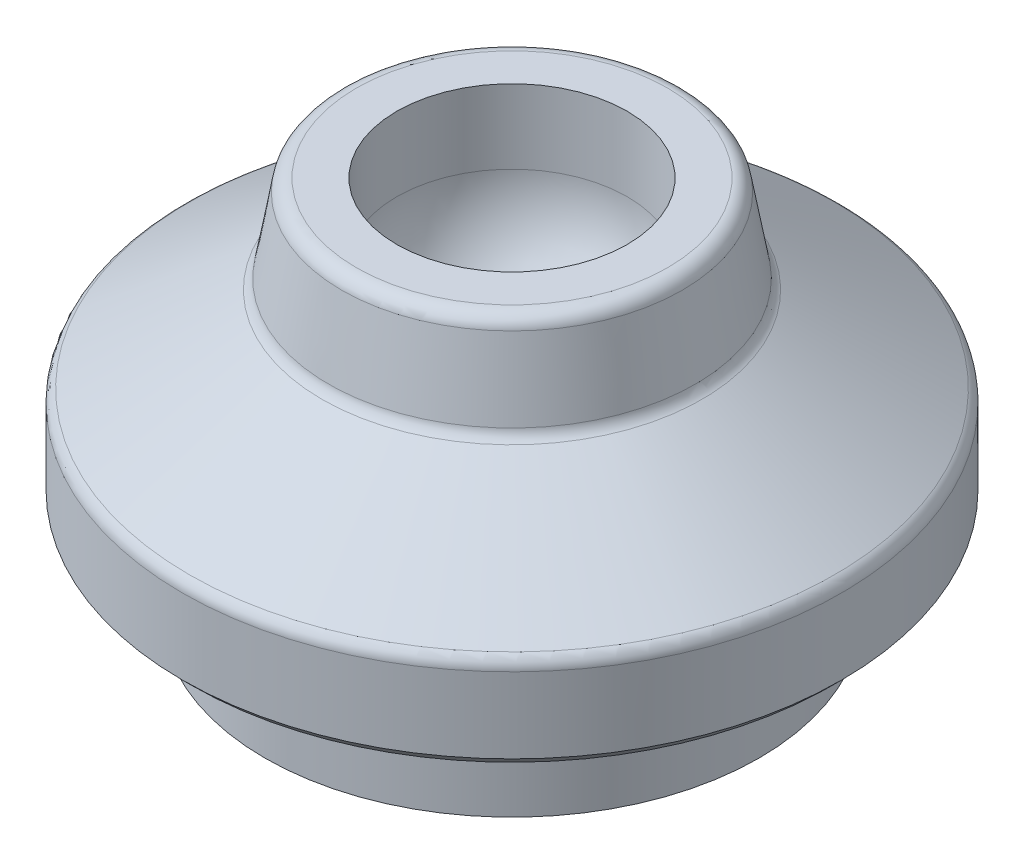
ISO-10303-21;
HEADER;
FILE_DESCRIPTION(('STEP AP214'),'2;1');
FILE_NAME('part.step','',(''),(''),'','','');
FILE_SCHEMA(('AUTOMOTIVE_DESIGN { 1 0 10303 214 1 1 1 1 }'));
ENDSEC;
DATA;
#1=APPLICATION_CONTEXT('core data for automotive mechanical design processes');
#2=APPLICATION_PROTOCOL_DEFINITION('international standard','automotive_design',2000,#1);
#3=PRODUCT_CONTEXT('',#1,'mechanical');
#4=PRODUCT('Part','Part','',(#3));
#5=PRODUCT_RELATED_PRODUCT_CATEGORY('part','',(#4));
#6=PRODUCT_DEFINITION_FORMATION('','',#4);
#7=PRODUCT_DEFINITION_CONTEXT('part definition',#1,'design');
#8=PRODUCT_DEFINITION('design','',#6,#7);
#9=PRODUCT_DEFINITION_SHAPE('','',#8);
#10=(LENGTH_UNIT() NAMED_UNIT(*) SI_UNIT(.MILLI.,.METRE.));
#11=(NAMED_UNIT(*) PLANE_ANGLE_UNIT() SI_UNIT($,.RADIAN.));
#12=(NAMED_UNIT(*) SI_UNIT($,.STERADIAN.) SOLID_ANGLE_UNIT());
#13=UNCERTAINTY_MEASURE_WITH_UNIT(LENGTH_MEASURE(1.E-05),#10,'distance_accuracy_value','');
#14=(GEOMETRIC_REPRESENTATION_CONTEXT(3) GLOBAL_UNCERTAINTY_ASSIGNED_CONTEXT((#13)) GLOBAL_UNIT_ASSIGNED_CONTEXT((#10,
#11,#12)) REPRESENTATION_CONTEXT('',''));
#15=CARTESIAN_POINT('',(0.,0.,0.));
#16=DIRECTION('',(0.,0.,1.));
#17=DIRECTION('',(1.,0.,0.));
#18=AXIS2_PLACEMENT_3D('',#15,#16,#17);
#19=CARTESIAN_POINT('',(6.51901066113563,17.,0.));
#20=DIRECTION('',(0.,-1.,0.));
#21=DIRECTION('',(0.,0.,-1.));
#22=AXIS2_PLACEMENT_3D('',#19,#20,#21);
#23=PLANE('',#22);
#24=CARTESIAN_POINT('',(0.,17.,0.));
#25=DIRECTION('',(0.,-1.,0.));
#26=DIRECTION('',(1.,0.,0.));
#27=AXIS2_PLACEMENT_3D('',#24,#25,#26);
#28=CIRCLE('',#27,6.99999331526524);
#29=CARTESIAN_POINT('',(6.99999331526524,17.,0.));
#30=VERTEX_POINT('',#29);
#31=EDGE_CURVE('E56',#30,#30,#28,.T.);
#32=ORIENTED_EDGE('',*,*,#31,.T.);
#33=EDGE_LOOP('',(#32));
#34=FACE_BOUND('',#33,.T.);
#35=CARTESIAN_POINT('',(0.,17.,0.));
#36=DIRECTION('',(0.,-1.,0.));
#37=DIRECTION('',(0.,0.,-1.));
#38=AXIS2_PLACEMENT_3D('',#35,#36,#37);
#39=CIRCLE('',#38,9.44562410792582);
#40=CARTESIAN_POINT('',(0.,17.,-9.44562410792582));
#41=VERTEX_POINT('',#40);
#42=EDGE_CURVE('E9',#41,#41,#39,.F.);
#43=ORIENTED_EDGE('',*,*,#42,.T.);
#44=EDGE_LOOP('',(#43));
#45=FACE_BOUND('',#44,.T.);
#46=ADVANCED_FACE('F15',(#34,#45),#23,.F.);
#47=CARTESIAN_POINT('',(0.,16.2562833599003,0.));
#48=DIRECTION('',(0.,-1.,0.));
#49=DIRECTION('',(0.,0.,-1.));
#50=AXIS2_PLACEMENT_3D('',#47,#48,#49);
#51=CONICAL_SURFACE('',#50,10.3319510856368,0.174532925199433);
#52=CARTESIAN_POINT('',(0.,11.7207527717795,0.));
#53=DIRECTION('',(0.,-1.,0.));
#54=DIRECTION('',(0.,0.,-1.));
#55=AXIS2_PLACEMENT_3D('',#52,#53,#54);
#56=CIRCLE('',#55,11.131687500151);
#57=CARTESIAN_POINT('',(0.,11.7207527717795,-11.131687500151));
#58=VERTEX_POINT('',#57);
#59=EDGE_CURVE('E26',#58,#58,#56,.F.);
#60=ORIENTED_EDGE('',*,*,#59,.T.);
#61=EDGE_LOOP('',(#60));
#62=FACE_BOUND('',#61,.T.);
#63=CARTESIAN_POINT('',(0.,16.2562833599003,0.));
#64=DIRECTION('',(0.,1.,0.));
#65=DIRECTION('',(0.,0.,1.));
#66=AXIS2_PLACEMENT_3D('',#63,#64,#65);
#67=CIRCLE('',#66,10.3319510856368);
#68=CARTESIAN_POINT('',(0.,16.2562833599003,10.3319510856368));
#69=VERTEX_POINT('',#68);
#70=EDGE_CURVE('E30',#69,#69,#67,.F.);
#71=ORIENTED_EDGE('',*,*,#70,.T.);
#72=EDGE_LOOP('',(#71));
#73=FACE_BOUND('',#72,.T.);
#74=ADVANCED_FACE('F100',(#62,#73),#51,.T.);
#75=CARTESIAN_POINT('',(0.,11.1203482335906,0.));
#76=DIRECTION('',(0.,-1.,0.));
#77=DIRECTION('',(0.,0.,-1.));
#78=AXIS2_PLACEMENT_3D('',#75,#76,#77);
#79=CONICAL_SURFACE('',#78,11.5307533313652,0.99869344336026);
#80=CARTESIAN_POINT('',(0.,11.1203482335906,0.));
#81=DIRECTION('',(0.,-1.,0.));
#82=DIRECTION('',(0.,0.,-1.));
#83=AXIS2_PLACEMENT_3D('',#80,#81,#82);
#84=CIRCLE('',#83,11.5307533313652);
#85=CARTESIAN_POINT('',(0.,11.1203482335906,-11.5307533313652));
#86=VERTEX_POINT('',#85);
#87=EDGE_CURVE('E35',#86,#86,#84,.T.);
#88=ORIENTED_EDGE('',*,*,#87,.T.);
#89=EDGE_LOOP('',(#88));
#90=FACE_BOUND('',#89,.T.);
#91=CARTESIAN_POINT('',(0.,5.93244547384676,0.));
#92=DIRECTION('',(0.,1.,0.));
#93=DIRECTION('',(0.,0.,1.));
#94=AXIS2_PLACEMENT_3D('',#91,#92,#93);
#95=CIRCLE('',#94,19.5872611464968);
#96=CARTESIAN_POINT('',(0.,5.93244547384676,19.5872611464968));
#97=VERTEX_POINT('',#96);
#98=EDGE_CURVE('E38',#97,#97,#95,.T.);
#99=ORIENTED_EDGE('',*,*,#98,.T.);
#100=EDGE_LOOP('',(#99));
#101=FACE_BOUND('',#100,.T.);
#102=ADVANCED_FACE('F97',(#90,#101),#79,.T.);
#103=CARTESIAN_POINT('',(0.,0.,0.));
#104=DIRECTION('',(0.,1.,0.));
#105=DIRECTION('',(0.,0.,1.));
#106=AXIS2_PLACEMENT_3D('',#103,#104,#105);
#107=CYLINDRICAL_SURFACE('',#106,20.);
#108=CARTESIAN_POINT('',(0.,5.17575757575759,0.));
#109=DIRECTION('',(0.,1.,0.));
#110=DIRECTION('',(0.,0.,1.));
#111=AXIS2_PLACEMENT_3D('',#108,#109,#110);
#112=CIRCLE('',#111,20.);
#113=CARTESIAN_POINT('',(0.,5.17575757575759,20.));
#114=VERTEX_POINT('',#113);
#115=EDGE_CURVE('E22',#114,#114,#112,.F.);
#116=ORIENTED_EDGE('',*,*,#115,.T.);
#117=EDGE_LOOP('',(#116));
#118=FACE_BOUND('',#117,.T.);
#119=CARTESIAN_POINT('',(0.,0.60000000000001,0.));
#120=DIRECTION('',(0.,-1.,0.));
#121=DIRECTION('',(0.,0.,-1.));
#122=AXIS2_PLACEMENT_3D('',#119,#120,#121);
#123=CIRCLE('',#122,20.);
#124=CARTESIAN_POINT('',(0.,0.60000000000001,-20.));
#125=VERTEX_POINT('',#124);
#126=EDGE_CURVE('E41',#125,#125,#123,.F.);
#127=ORIENTED_EDGE('',*,*,#126,.T.);
#128=EDGE_LOOP('',(#127));
#129=FACE_BOUND('',#128,.T.);
#130=ADVANCED_FACE('F90',(#118,#129),#107,.T.);
#131=CARTESIAN_POINT('',(0.,0.,0.));
#132=DIRECTION('',(0.,-1.,0.));
#133=DIRECTION('',(0.,0.,-1.));
#134=AXIS2_PLACEMENT_3D('',#131,#132,#133);
#135=PLANE('',#134);
#136=CARTESIAN_POINT('',(0.,0.,0.));
#137=DIRECTION('',(0.,-1.,0.));
#138=DIRECTION('',(0.,0.,-1.));
#139=AXIS2_PLACEMENT_3D('',#136,#137,#138);
#140=CIRCLE('',#139,19.4);
#141=CARTESIAN_POINT('',(0.,0.,-19.4));
#142=VERTEX_POINT('',#141);
#143=EDGE_CURVE('E44',#142,#142,#140,.T.);
#144=ORIENTED_EDGE('',*,*,#143,.T.);
#145=EDGE_LOOP('',(#144));
#146=FACE_BOUND('',#145,.T.);
#147=CARTESIAN_POINT('',(0.,0.,0.));
#148=DIRECTION('',(0.,-1.,0.));
#149=DIRECTION('',(0.,0.,-1.));
#150=AXIS2_PLACEMENT_3D('',#147,#148,#149);
#151=CIRCLE('',#150,15.);
#152=CARTESIAN_POINT('',(0.,0.,-15.));
#153=VERTEX_POINT('',#152);
#154=EDGE_CURVE('E47',#153,#153,#151,.T.);
#155=ORIENTED_EDGE('',*,*,#154,.F.);
#156=EDGE_LOOP('',(#155));
#157=FACE_BOUND('',#156,.T.);
#158=ADVANCED_FACE('F85',(#146,#157),#135,.T.);
#159=CARTESIAN_POINT('',(0.,-6.,0.));
#160=DIRECTION('',(0.,1.,0.));
#161=DIRECTION('',(0.,0.,1.));
#162=AXIS2_PLACEMENT_3D('',#159,#160,#161);
#163=CYLINDRICAL_SURFACE('',#162,15.);
#164=CARTESIAN_POINT('',(0.,-6.,0.));
#165=DIRECTION('',(0.,-1.,0.));
#166=DIRECTION('',(0.,0.,-1.));
#167=AXIS2_PLACEMENT_3D('',#164,#165,#166);
#168=CIRCLE('',#167,15.);
#169=CARTESIAN_POINT('',(0.,-6.,-15.));
#170=VERTEX_POINT('',#169);
#171=EDGE_CURVE('E50',#170,#170,#168,.T.);
#172=ORIENTED_EDGE('',*,*,#171,.F.);
#173=EDGE_LOOP('',(#172));
#174=FACE_BOUND('',#173,.T.);
#175=ORIENTED_EDGE('',*,*,#154,.T.);
#176=EDGE_LOOP('',(#175));
#177=FACE_BOUND('',#176,.T.);
#178=ADVANCED_FACE('F79',(#174,#177),#163,.T.);
#179=CARTESIAN_POINT('',(0.,-6.,0.));
#180=DIRECTION('',(0.,-1.,0.));
#181=DIRECTION('',(0.,0.,-1.));
#182=AXIS2_PLACEMENT_3D('',#179,#180,#181);
#183=PLANE('',#182);
#184=CARTESIAN_POINT('',(0.,-6.,0.));
#185=DIRECTION('',(0.,-1.,0.));
#186=DIRECTION('',(0.,0.,-1.));
#187=AXIS2_PLACEMENT_3D('',#184,#185,#186);
#188=CIRCLE('',#187,9.);
#189=CARTESIAN_POINT('',(0.,-6.,-9.));
#190=VERTEX_POINT('',#189);
#191=EDGE_CURVE('E60',#190,#190,#188,.T.);
#192=ORIENTED_EDGE('',*,*,#191,.F.);
#193=EDGE_LOOP('',(#192));
#194=FACE_BOUND('',#193,.T.);
#195=ORIENTED_EDGE('',*,*,#171,.T.);
#196=EDGE_LOOP('',(#195));
#197=FACE_BOUND('',#196,.T.);
#198=ADVANCED_FACE('F75',(#194,#197),#183,.T.);
#199=CARTESIAN_POINT('',(0.,0.,0.));
#200=DIRECTION('',(0.,1.,0.));
#201=DIRECTION('',(0.,0.,1.));
#202=AXIS2_PLACEMENT_3D('',#199,#200,#201);
#203=CONICAL_SURFACE('',#202,19.4,0.785398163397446);
#204=ORIENTED_EDGE('',*,*,#126,.F.);
#205=EDGE_LOOP('',(#204));
#206=FACE_BOUND('',#205,.T.);
#207=ORIENTED_EDGE('',*,*,#143,.F.);
#208=EDGE_LOOP('',(#207));
#209=FACE_BOUND('',#208,.T.);
#210=ADVANCED_FACE('F78',(#206,#209),#203,.T.);
#211=CARTESIAN_POINT('',(0.,11.8770361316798,0.));
#212=DIRECTION('',(0.,-1.,0.));
#213=DIRECTION('',(0.,0.,-1.));
#214=AXIS2_PLACEMENT_3D('',#211,#212,#213);
#215=TOROIDAL_SURFACE('',#214,12.018014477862,0.9);
#216=ORIENTED_EDGE('',*,*,#59,.F.);
#217=EDGE_LOOP('',(#216));
#218=FACE_BOUND('',#217,.T.);
#219=ORIENTED_EDGE('',*,*,#87,.F.);
#220=EDGE_LOOP('',(#219));
#221=FACE_BOUND('',#220,.T.);
#222=ADVANCED_FACE('F116',(#218,#221),#215,.F.);
#223=CARTESIAN_POINT('',(0.,5.17575757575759,0.));
#224=DIRECTION('',(0.,1.,0.));
#225=DIRECTION('',(0.,0.,1.));
#226=AXIS2_PLACEMENT_3D('',#223,#224,#225);
#227=TOROIDAL_SURFACE('',#226,19.1,0.9);
#228=ORIENTED_EDGE('',*,*,#98,.F.);
#229=EDGE_LOOP('',(#228));
#230=FACE_BOUND('',#229,.T.);
#231=ORIENTED_EDGE('',*,*,#115,.F.);
#232=EDGE_LOOP('',(#231));
#233=FACE_BOUND('',#232,.T.);
#234=ADVANCED_FACE('F119',(#230,#233),#227,.T.);
#235=CARTESIAN_POINT('',(0.,16.1,0.));
#236=DIRECTION('',(0.,-1.,0.));
#237=DIRECTION('',(0.,0.,-1.));
#238=AXIS2_PLACEMENT_3D('',#235,#236,#237);
#239=TOROIDAL_SURFACE('',#238,9.44562410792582,0.9);
#240=ORIENTED_EDGE('',*,*,#70,.F.);
#241=EDGE_LOOP('',(#240));
#242=FACE_BOUND('',#241,.T.);
#243=ORIENTED_EDGE('',*,*,#42,.F.);
#244=EDGE_LOOP('',(#243));
#245=FACE_BOUND('',#244,.T.);
#246=ADVANCED_FACE('F17',(#242,#245),#239,.T.);
#247=CARTESIAN_POINT('',(0.,5.5,0.));
#248=DIRECTION('',(0.,-1.,0.));
#249=DIRECTION('',(1.,0.,0.));
#250=AXIS2_PLACEMENT_3D('',#247,#248,#249);
#251=CYLINDRICAL_SURFACE('',#250,6.99999331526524);
#252=ORIENTED_EDGE('',*,*,#31,.F.);
#253=EDGE_LOOP('',(#252));
#254=FACE_BOUND('',#253,.T.);
#255=CARTESIAN_POINT('',(0.,12.5096739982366,0.));
#256=DIRECTION('',(0.,-1.,0.));
#257=DIRECTION('',(1.,0.,0.));
#258=AXIS2_PLACEMENT_3D('',#255,#256,#257);
#259=CIRCLE('',#258,6.99999331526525);
#260=CARTESIAN_POINT('',(6.99999331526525,12.5096739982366,0.));
#261=VERTEX_POINT('',#260);
#262=EDGE_CURVE('E53',#261,#261,#259,.T.);
#263=ORIENTED_EDGE('',*,*,#262,.T.);
#264=EDGE_LOOP('',(#263));
#265=FACE_BOUND('',#264,.T.);
#266=ADVANCED_FACE('F126',(#254,#265),#251,.F.);
#267=CARTESIAN_POINT('',(0.,12.5,0.));
#268=DIRECTION('',(0.,-1.,0.));
#269=DIRECTION('',(1.,0.,0.));
#270=AXIS2_PLACEMENT_3D('',#267,#268,#269);
#271=SPHERICAL_SURFACE('',#270,7.);
#272=ORIENTED_EDGE('',*,*,#262,.F.);
#273=EDGE_LOOP('',(#272));
#274=FACE_BOUND('',#273,.T.);
#275=ADVANCED_FACE('F71',(#274),#271,.F.);
#276=CARTESIAN_POINT('',(0.,0.,0.));
#277=DIRECTION('',(0.,-1.,0.));
#278=DIRECTION('',(0.,0.,-1.));
#279=AXIS2_PLACEMENT_3D('',#276,#277,#278);
#280=CYLINDRICAL_SURFACE('',#279,9.);
#281=CARTESIAN_POINT('',(0.,0.,0.));
#282=DIRECTION('',(0.,-1.,0.));
#283=DIRECTION('',(0.,0.,-1.));
#284=AXIS2_PLACEMENT_3D('',#281,#282,#283);
#285=CIRCLE('',#284,9.);
#286=CARTESIAN_POINT('',(0.,0.,-9.));
#287=VERTEX_POINT('',#286);
#288=EDGE_CURVE('E59',#287,#287,#285,.T.);
#289=ORIENTED_EDGE('',*,*,#288,.F.);
#290=EDGE_LOOP('',(#289));
#291=FACE_BOUND('',#290,.T.);
#292=ORIENTED_EDGE('',*,*,#191,.T.);
#293=EDGE_LOOP('',(#292));
#294=FACE_BOUND('',#293,.T.);
#295=ADVANCED_FACE('F68',(#291,#294),#280,.F.);
#296=CARTESIAN_POINT('',(0.,0.,0.));
#297=DIRECTION('',(0.,-1.,0.));
#298=DIRECTION('',(0.,0.,-1.));
#299=AXIS2_PLACEMENT_3D('',#296,#297,#298);
#300=PLANE('',#299);
#301=ORIENTED_EDGE('',*,*,#288,.T.);
#302=EDGE_LOOP('',(#301));
#303=FACE_BOUND('',#302,.T.);
#304=ADVANCED_FACE('F66',(#303),#300,.T.);
#305=CLOSED_SHELL('',(#46,#74,#102,#130,#158,#178,#198,#210,#222,#234,#246,#266,#275,#295,#304));
#306=MANIFOLD_SOLID_BREP('B1',#305);
#307=ADVANCED_BREP_SHAPE_REPRESENTATION('',(#18,#306),#14);
#308=SHAPE_DEFINITION_REPRESENTATION(#9,#307);
ENDSEC;
END-ISO-10303-21;
